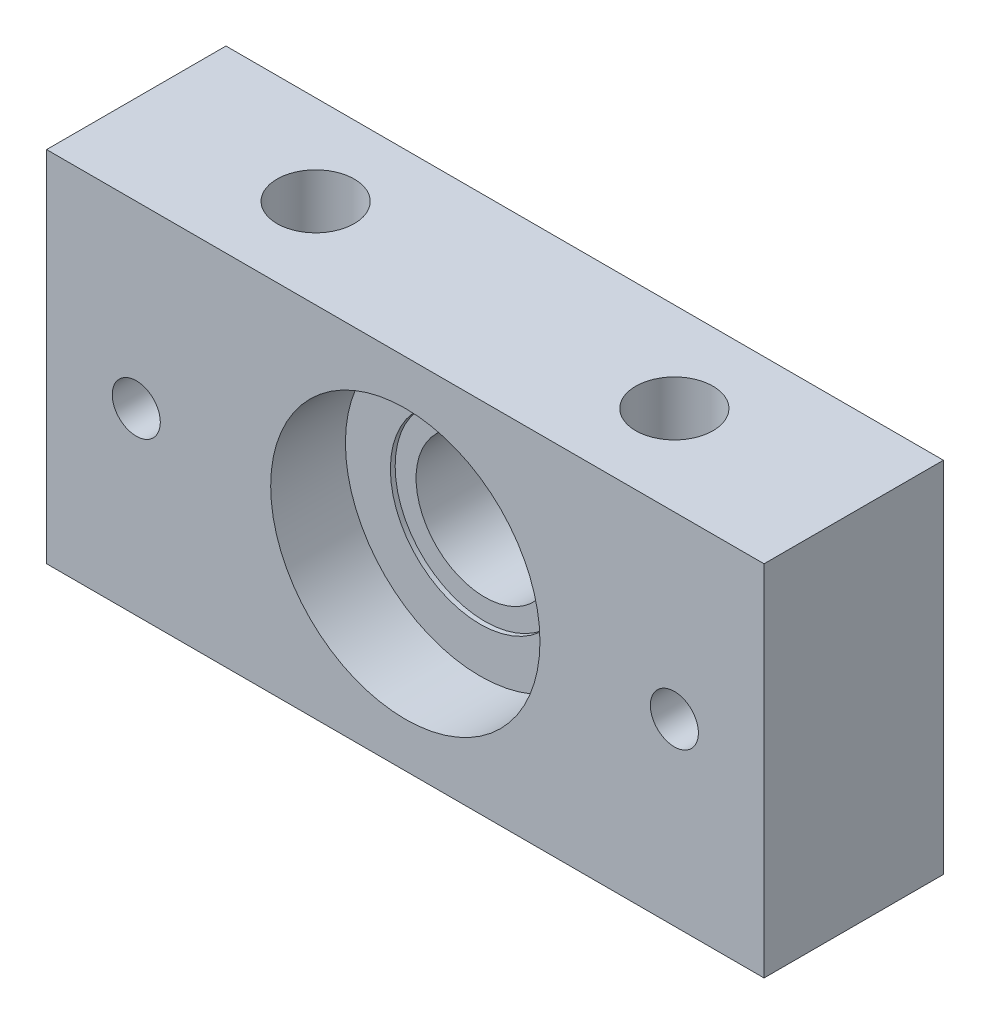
from build123d import *

# Parameters (mm, degrees)
SKETCH1_W                = 76.2
SKETCH1_H                = 38.1
EXTRUDE1_DEPTH           = 19.05
F_5_16_CLEARANCE_HOLE1_D = 8.2042
SKETCH5_R                = 14.3002
CUT_EXTRUDE1_DEPTH       = 7.9375
SKETCH6_R                = 7.3025
CUT_EXTRUDE2_DEPTH       = 86.915875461
F_1_4_20_TAPPED_HOLE1_D  = 5.1054
SKETCH9_R                = 9.525
CUT_EXTRUDE3_DEPTH       = 0.508


with BuildPart() as part:
    # Sketch1 → Extrude1 (new body)
    with BuildSketch(Plane.XY):
        with Locations((38.1, 19.05)):
            Rectangle(SKETCH1_W, SKETCH1_H)
    extrude(amount=EXTRUDE1_DEPTH)

    # 5_16 Clearance Hole1 (through all)
    with Locations(Plane(origin=(0, 38.1, 0), x_dir=(-1, 0, 0), z_dir=(0, 1, 0))):
        with Locations((-19.05, 9.525), (-57.15, 9.525)):
            Hole(F_5_16_CLEARANCE_HOLE1_D / 2)

    # Sketch5 → Cut-Extrude1 (cut)
    with BuildSketch(Plane.XY.offset(19.05)):
        with Locations((38.1, 19.05)):
            Circle(SKETCH5_R)
    extrude(amount=-CUT_EXTRUDE1_DEPTH, mode=Mode.SUBTRACT)

    # Sketch6 → Cut-Extrude2 (cut, through all)
    with BuildSketch(Plane.XY.offset(11.1125)):
        with Locations((38.1, 19.05)):
            Circle(SKETCH6_R)
    extrude(amount=-CUT_EXTRUDE2_DEPTH, mode=Mode.SUBTRACT)

    # 1_4-20 Tapped Hole1 (through all)
    with Locations(Plane.XY.offset(19.05)):
        with Locations((9.525, 19.05), (66.675, 19.05)):
            Hole(F_1_4_20_TAPPED_HOLE1_D / 2)

    # Sketch9 → Cut-Extrude3 (cut)
    with BuildSketch(Plane.XY.offset(11.1125)):
        with Locations((38.1, 19.05)):
            Circle(SKETCH9_R)
    extrude(amount=-CUT_EXTRUDE3_DEPTH, mode=Mode.SUBTRACT)


solid = part.part
